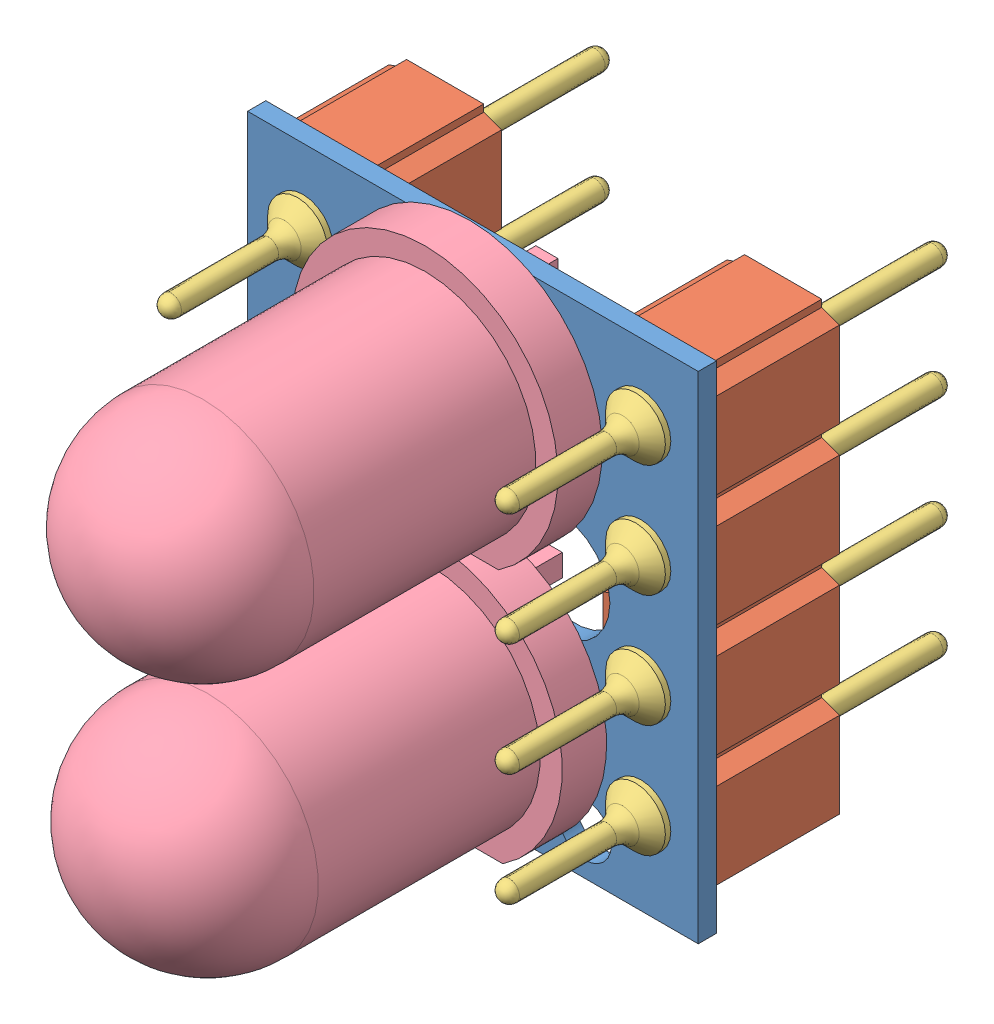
SolidWorks assembly Generic Line Sensor.SLDASM, configuration Default (file format 7000). Lengths in mm.
Overall size (10.18 11.55 15.31).
15 component instances, 4 part files, 13 mates.
Components (placement in the parent):
- TCRT5000 Breakout Board-1: TCRT5000 Breakout Board.SLDPRT [Default] at (-56.884 11.4692 23.5029) size (10.16 11.18 0.41)
- 4 Pin Header-1: 4 Pin Header.SLDASM [Default] at (-53.857 16.3496 20.2974) x (0 -1 0) z (1 0 0) size (10.16 10.01 2.54)
  - mill-max-350-40-104-00-006000_P3XX-11-010-00-000000(P304-11-010-00-000000)-1: mill-max-350-40-104-00-006000_P3XX-11-010-00-000000(P304-11-010-00-000000).sldprt [Default] at origin size (10.16 2.79 2.54)
  - mill-max-350-40-104-00-006000_3404(3404-0-00-80-00-00-03-0)-1: mill-max-350-40-104-00-006000_3404(3404-0-00-80-00-00-03-0).sldprt [Default] at (6.0444 3.6068 -1.27) x (0 -1 0) z (0 0 1) size (10.01 1.83 1.83)
  - mill-max-350-40-104-00-006000_3404(3404-0-00-80-00-00-03-0)-2: mill-max-350-40-104-00-006000_3404(3404-0-00-80-00-00-03-0).sldprt [Default] at (0.9644 3.6068 -1.27) x (0 -1 0) z (0 0 1) size (10.01 1.83 1.83)
  - mill-max-350-40-104-00-006000_3404(3404-0-00-80-00-00-03-0)-3: mill-max-350-40-104-00-006000_3404(3404-0-00-80-00-00-03-0).sldprt [Default] at (3.5044 3.6068 -1.27) x (0 -1 0) z (0 0 1) size (10.01 1.83 1.83)
  - mill-max-350-40-104-00-006000_3404(3404-0-00-80-00-00-03-0)-4: mill-max-350-40-104-00-006000_3404(3404-0-00-80-00-00-03-0).sldprt [Default] at (8.5844 3.6068 -1.27) x (0 -1 0) z (0 0 1) size (10.01 1.83 1.83)
- 4 Pin Header-2: 4 Pin Header.SLDASM [Default] at (-61.477 16.3496 20.2974) x (0 -1 0) z (1 0 0) size (10.16 10.01 2.54)
  - mill-max-350-40-104-00-006000_P3XX-11-010-00-000000(P304-11-010-00-000000)-1: mill-max-350-40-104-00-006000_P3XX-11-010-00-000000(P304-11-010-00-000000).sldprt [Default] at origin size (10.16 2.79 2.54)
  - mill-max-350-40-104-00-006000_3404(3404-0-00-80-00-00-03-0)-1: mill-max-350-40-104-00-006000_3404(3404-0-00-80-00-00-03-0).sldprt [Default] at (6.0444 3.6068 -1.27) x (0 -1 0) z (0 0 1) size (10.01 1.83 1.83)
  - mill-max-350-40-104-00-006000_3404(3404-0-00-80-00-00-03-0)-2: mill-max-350-40-104-00-006000_3404(3404-0-00-80-00-00-03-0).sldprt [Default] at (0.9644 3.6068 -1.27) x (0 -1 0) z (0 0 1) size (10.01 1.83 1.83)
  - mill-max-350-40-104-00-006000_3404(3404-0-00-80-00-00-03-0)-3: mill-max-350-40-104-00-006000_3404(3404-0-00-80-00-00-03-0).sldprt [Default] at (3.5044 3.6068 -1.27) x (0 -1 0) z (0 0 1) size (10.01 1.83 1.83)
  - mill-max-350-40-104-00-006000_3404(3404-0-00-80-00-00-03-0)-4: mill-max-350-40-104-00-006000_3404(3404-0-00-80-00-00-03-0).sldprt [Default] at (8.5844 3.6068 -1.27) x (0 -1 0) z (0 0 1) size (10.01 1.83 1.83)
- 5mm LED Clear-1: 5mm LED Clear.SLDPRT [Default] at (-58.9002 8.7422 23.5029) x (1 0 0) z (0 -1 0) size (6 11.5 5.5)
- 5mm LED Clear-2: 5mm LED Clear.SLDPRT [Default] at (-58.9972 14.4312 23.5029) x (1 0 0) z (0 -1 0) size (6 11.5 5.5)
Mates (geometry in assembly coordinates):
- Concentric4: concentric aligned: cylinder of TCRT5000 Breakout Board-1 through (-55.127 15.3852 23.0914) axis (0 0 -1) radius 0.5; cylinder of 4 Pin Header-1/mill-max-350-40-104-00-006000_3404(3404-0-00-80-00-00-03-0)-2 through (-55.127 15.3852 16.6906) axis (0 0 -1) radius 0.2286
- Concentric5: concentric aligned: circle of TCRT5000 Breakout Board-1; cylinder of 4 Pin Header-1/mill-max-350-40-104-00-006000_3404(3404-0-00-80-00-00-03-0)-4 through (-55.127 7.7652 16.6906) axis (0 0 -1) radius 0.2286
- Coincident2: coincident anti-aligned: plane of TCRT5000 Breakout Board-1 through (-63.996 5.8812 23.0914) normal (0 0 -1); plane of 4 Pin Header-1/mill-max-350-40-104-00-006000_P3XX-11-010-00-000000(P304-11-010-00-000000)-1 through (-56.397 16.3496 23.0914) normal (0 0 1)
- Concentric6: concentric aligned: cylinder of TCRT5000 Breakout Board-1 through (-62.747 15.3852 23.0914) axis (0 0 -1) radius 0.5; cylinder of 4 Pin Header-2/mill-max-350-40-104-00-006000_3404(3404-0-00-80-00-00-03-0)-2 through (-62.747 15.3852 16.6906) axis (0 0 -1) radius 0.2286
- Concentric7: concentric aligned: circle of TCRT5000 Breakout Board-1; cylinder of 4 Pin Header-2/mill-max-350-40-104-00-006000_3404(3404-0-00-80-00-00-03-0)-4 through (-62.747 7.7652 16.6906) axis (0 0 -1) radius 0.2286
- Coincident3: coincident anti-aligned: plane of TCRT5000 Breakout Board-1 through (-63.996 5.8812 23.0914) normal (0 0 -1); plane of 4 Pin Header-2/mill-max-350-40-104-00-006000_P3XX-11-010-00-000000(P304-11-010-00-000000)-1 through (-64.017 16.3496 23.0914) normal (0 0 1)
- Width1: width: plane of 5mm LED Clear-1 through (-57.9002 8.4922 20.5029) normal (0 -1 0); plane of 5mm LED Clear-1 through (-57.9002 8.9922 20.5029) normal (0 1 0); cylinder of TCRT5000 Breakout Board-1 through (-57.662 8.7422 23.0914) axis (0 0 -1) radius 0.5
- Coincident4: coincident: plane of TCRT5000 Breakout Board-1 through (-63.996 5.8812 23.5029) normal (0 0 1); plane of 5mm LED Clear-1 through (-58.9002 8.7422 23.5029) normal (0 0 -1)
- Parallel1: parallel: plane of 5mm LED Clear-1 through (-60.5586 6.2422 24.5029) normal (0 -1 0); plane of TCRT5000 Breakout Board-1 through (-53.836 5.8812 23.0914) normal (0 -1 0)
- Lock1: lock: unknown of TCRT5000 Breakout Board-1; unknown of 5mm LED Clear-1
- Coincident5: coincident: plane of TCRT5000 Breakout Board-1 through (-63.996 5.8812 23.5029) normal (0 0 1); plane of 5mm LED Clear-2 through (-58.9972 14.4312 23.5029) normal (0 0 -1)
- Parallel2: parallel: plane of TCRT5000 Breakout Board-1 through (-53.836 5.8812 23.0914) normal (0 -1 0); plane of 5mm LED Clear-2 through (-60.6556 11.9312 24.5029) normal (0 -1 0)
- Lock2: lock: unknown of TCRT5000 Breakout Board-1; unknown of 5mm LED Clear-2
